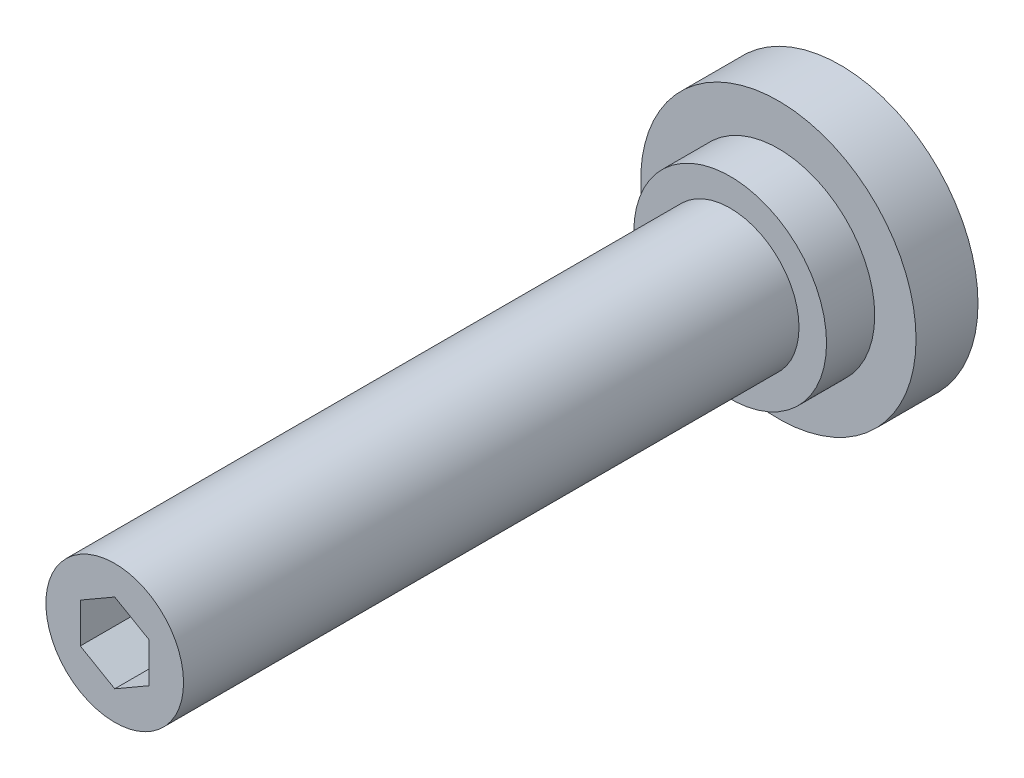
ISO-10303-21;
HEADER;
FILE_DESCRIPTION(('STEP AP214'),'2;1');
FILE_NAME('part.step','',(''),(''),'','','');
FILE_SCHEMA(('AUTOMOTIVE_DESIGN { 1 0 10303 214 1 1 1 1 }'));
ENDSEC;
DATA;
#1=APPLICATION_CONTEXT('core data for automotive mechanical design processes');
#2=APPLICATION_PROTOCOL_DEFINITION('international standard','automotive_design',2000,#1);
#3=PRODUCT_CONTEXT('',#1,'mechanical');
#4=PRODUCT('Part','Part','',(#3));
#5=PRODUCT_RELATED_PRODUCT_CATEGORY('part','',(#4));
#6=PRODUCT_DEFINITION_FORMATION('','',#4);
#7=PRODUCT_DEFINITION_CONTEXT('part definition',#1,'design');
#8=PRODUCT_DEFINITION('design','',#6,#7);
#9=PRODUCT_DEFINITION_SHAPE('','',#8);
#10=(LENGTH_UNIT() NAMED_UNIT(*) SI_UNIT(.MILLI.,.METRE.));
#11=(NAMED_UNIT(*) PLANE_ANGLE_UNIT() SI_UNIT($,.RADIAN.));
#12=(NAMED_UNIT(*) SI_UNIT($,.STERADIAN.) SOLID_ANGLE_UNIT());
#13=UNCERTAINTY_MEASURE_WITH_UNIT(LENGTH_MEASURE(1.E-05),#10,'distance_accuracy_value','');
#14=(GEOMETRIC_REPRESENTATION_CONTEXT(3) GLOBAL_UNCERTAINTY_ASSIGNED_CONTEXT((#13)) GLOBAL_UNIT_ASSIGNED_CONTEXT((#10,
#11,#12)) REPRESENTATION_CONTEXT('',''));
#15=CARTESIAN_POINT('',(0.,0.,0.));
#16=DIRECTION('',(0.,0.,1.));
#17=DIRECTION('',(1.,0.,0.));
#18=AXIS2_PLACEMENT_3D('',#15,#16,#17);
#19=CARTESIAN_POINT('',(0.,0.,105.4));
#20=DIRECTION('',(0.,0.,1.));
#21=DIRECTION('',(1.,0.,0.));
#22=AXIS2_PLACEMENT_3D('',#19,#20,#21);
#23=PLANE('',#22);
#24=DIRECTION('',(-0.866025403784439,0.5,0.));
#25=VECTOR('',#24,1.);
#26=CARTESIAN_POINT('',(5.,2.88675134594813,105.4));
#27=LINE('',#26,#25);
#28=CARTESIAN_POINT('',(5.,2.88675134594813,105.4));
#29=VERTEX_POINT('',#28);
#30=CARTESIAN_POINT('',(0.,5.77350269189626,105.4));
#31=VERTEX_POINT('',#30);
#32=EDGE_CURVE('E28',#29,#31,#27,.T.);
#33=ORIENTED_EDGE('',*,*,#32,.F.);
#34=DIRECTION('',(0.,1.,0.));
#35=VECTOR('',#34,1.);
#36=CARTESIAN_POINT('',(5.,-2.88675134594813,105.4));
#37=LINE('',#36,#35);
#38=CARTESIAN_POINT('',(5.,-2.88675134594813,105.4));
#39=VERTEX_POINT('',#38);
#40=EDGE_CURVE('E111',#39,#29,#37,.T.);
#41=ORIENTED_EDGE('',*,*,#40,.F.);
#42=DIRECTION('',(0.866025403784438,0.5,0.));
#43=VECTOR('',#42,1.);
#44=CARTESIAN_POINT('',(0.,-5.77350269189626,105.4));
#45=LINE('',#44,#43);
#46=CARTESIAN_POINT('',(0.,-5.77350269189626,105.4));
#47=VERTEX_POINT('',#46);
#48=EDGE_CURVE('E109',#47,#39,#45,.T.);
#49=ORIENTED_EDGE('',*,*,#48,.F.);
#50=DIRECTION('',(0.866025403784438,-0.5,0.));
#51=VECTOR('',#50,1.);
#52=CARTESIAN_POINT('',(-5.,-2.88675134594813,105.4));
#53=LINE('',#52,#51);
#54=CARTESIAN_POINT('',(-5.,-2.88675134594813,105.4));
#55=VERTEX_POINT('',#54);
#56=EDGE_CURVE('E76',#55,#47,#53,.T.);
#57=ORIENTED_EDGE('',*,*,#56,.F.);
#58=DIRECTION('',(0.,-1.,0.));
#59=VECTOR('',#58,1.);
#60=CARTESIAN_POINT('',(-5.,2.88675134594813,105.4));
#61=LINE('',#60,#59);
#62=CARTESIAN_POINT('',(-5.,2.88675134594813,105.4));
#63=VERTEX_POINT('',#62);
#64=EDGE_CURVE('E105',#63,#55,#61,.T.);
#65=ORIENTED_EDGE('',*,*,#64,.F.);
#66=DIRECTION('',(-0.866025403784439,-0.5,0.));
#67=VECTOR('',#66,1.);
#68=CARTESIAN_POINT('',(0.,5.77350269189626,105.4));
#69=LINE('',#68,#67);
#70=EDGE_CURVE('E102',#31,#63,#69,.T.);
#71=ORIENTED_EDGE('',*,*,#70,.F.);
#72=EDGE_LOOP('',(#33,#41,#49,#57,#65,#71));
#73=FACE_BOUND('',#72,.T.);
#74=CARTESIAN_POINT('',(0.,0.,105.4));
#75=DIRECTION('',(0.,0.,1.));
#76=DIRECTION('',(1.,0.,0.));
#77=AXIS2_PLACEMENT_3D('',#74,#75,#76);
#78=CIRCLE('',#77,10.);
#79=CARTESIAN_POINT('',(10.,0.,105.4));
#80=VERTEX_POINT('',#79);
#81=EDGE_CURVE('E9',#80,#80,#78,.T.);
#82=ORIENTED_EDGE('',*,*,#81,.T.);
#83=EDGE_LOOP('',(#82));
#84=FACE_BOUND('',#83,.T.);
#85=ADVANCED_FACE('F14',(#73,#84),#23,.T.);
#86=CARTESIAN_POINT('',(0.,0.,30.));
#87=DIRECTION('',(0.,0.,1.));
#88=DIRECTION('',(1.,0.,0.));
#89=AXIS2_PLACEMENT_3D('',#86,#87,#88);
#90=CYLINDRICAL_SURFACE('',#89,10.);
#91=CARTESIAN_POINT('',(0.,0.,16.));
#92=DIRECTION('',(0.,0.,1.));
#93=DIRECTION('',(1.,0.,0.));
#94=AXIS2_PLACEMENT_3D('',#91,#92,#93);
#95=CIRCLE('',#94,10.);
#96=CARTESIAN_POINT('',(10.,0.,16.));
#97=VERTEX_POINT('',#96);
#98=EDGE_CURVE('E21',#97,#97,#95,.T.);
#99=ORIENTED_EDGE('',*,*,#98,.T.);
#100=EDGE_LOOP('',(#99));
#101=FACE_BOUND('',#100,.T.);
#102=ORIENTED_EDGE('',*,*,#81,.F.);
#103=EDGE_LOOP('',(#102));
#104=FACE_BOUND('',#103,.T.);
#105=ADVANCED_FACE('F134',(#101,#104),#90,.T.);
#106=CARTESIAN_POINT('',(-10.,0.,16.));
#107=DIRECTION('',(0.,0.,1.));
#108=DIRECTION('',(1.,0.,0.));
#109=AXIS2_PLACEMENT_3D('',#106,#107,#108);
#110=PLANE('',#109);
#111=CARTESIAN_POINT('',(0.,0.,16.));
#112=DIRECTION('',(0.,0.,1.));
#113=DIRECTION('',(1.,0.,0.));
#114=AXIS2_PLACEMENT_3D('',#111,#112,#113);
#115=CIRCLE('',#114,14.);
#116=CARTESIAN_POINT('',(14.,0.,16.));
#117=VERTEX_POINT('',#116);
#118=EDGE_CURVE('E129',#117,#117,#115,.T.);
#119=ORIENTED_EDGE('',*,*,#118,.T.);
#120=EDGE_LOOP('',(#119));
#121=FACE_BOUND('',#120,.T.);
#122=ORIENTED_EDGE('',*,*,#98,.F.);
#123=EDGE_LOOP('',(#122));
#124=FACE_BOUND('',#123,.T.);
#125=ADVANCED_FACE('F137',(#121,#124),#110,.T.);
#126=CARTESIAN_POINT('',(0.,0.,30.));
#127=DIRECTION('',(0.,0.,1.));
#128=DIRECTION('',(1.,0.,0.));
#129=AXIS2_PLACEMENT_3D('',#126,#127,#128);
#130=CYLINDRICAL_SURFACE('',#129,14.);
#131=CARTESIAN_POINT('',(0.,0.,9.));
#132=DIRECTION('',(0.,0.,1.));
#133=DIRECTION('',(1.,0.,0.));
#134=AXIS2_PLACEMENT_3D('',#131,#132,#133);
#135=CIRCLE('',#134,14.);
#136=CARTESIAN_POINT('',(14.,0.,9.));
#137=VERTEX_POINT('',#136);
#138=EDGE_CURVE('E126',#137,#137,#135,.T.);
#139=ORIENTED_EDGE('',*,*,#138,.T.);
#140=EDGE_LOOP('',(#139));
#141=FACE_BOUND('',#140,.T.);
#142=ORIENTED_EDGE('',*,*,#118,.F.);
#143=EDGE_LOOP('',(#142));
#144=FACE_BOUND('',#143,.T.);
#145=ADVANCED_FACE('F139',(#141,#144),#130,.T.);
#146=CARTESIAN_POINT('',(-14.,0.,9.));
#147=DIRECTION('',(0.,0.,1.));
#148=DIRECTION('',(1.,0.,0.));
#149=AXIS2_PLACEMENT_3D('',#146,#147,#148);
#150=PLANE('',#149);
#151=CARTESIAN_POINT('',(0.,0.,9.));
#152=DIRECTION('',(0.,0.,1.));
#153=DIRECTION('',(1.,0.,0.));
#154=AXIS2_PLACEMENT_3D('',#151,#152,#153);
#155=CIRCLE('',#154,20.);
#156=CARTESIAN_POINT('',(20.,0.,9.));
#157=VERTEX_POINT('',#156);
#158=EDGE_CURVE('E123',#157,#157,#155,.T.);
#159=ORIENTED_EDGE('',*,*,#158,.T.);
#160=EDGE_LOOP('',(#159));
#161=FACE_BOUND('',#160,.T.);
#162=ORIENTED_EDGE('',*,*,#138,.F.);
#163=EDGE_LOOP('',(#162));
#164=FACE_BOUND('',#163,.T.);
#165=ADVANCED_FACE('F147',(#161,#164),#150,.T.);
#166=CARTESIAN_POINT('',(0.,0.,30.));
#167=DIRECTION('',(0.,0.,1.));
#168=DIRECTION('',(1.,0.,0.));
#169=AXIS2_PLACEMENT_3D('',#166,#167,#168);
#170=CYLINDRICAL_SURFACE('',#169,20.);
#171=CARTESIAN_POINT('',(0.,0.,0.));
#172=DIRECTION('',(0.,0.,1.));
#173=DIRECTION('',(1.,0.,0.));
#174=AXIS2_PLACEMENT_3D('',#171,#172,#173);
#175=CIRCLE('',#174,20.);
#176=CARTESIAN_POINT('',(20.,0.,0.));
#177=VERTEX_POINT('',#176);
#178=EDGE_CURVE('E115',#177,#177,#175,.T.);
#179=ORIENTED_EDGE('',*,*,#178,.T.);
#180=EDGE_LOOP('',(#179));
#181=FACE_BOUND('',#180,.T.);
#182=ORIENTED_EDGE('',*,*,#158,.F.);
#183=EDGE_LOOP('',(#182));
#184=FACE_BOUND('',#183,.T.);
#185=ADVANCED_FACE('F172',(#181,#184),#170,.T.);
#186=CARTESIAN_POINT('',(-20.,0.,0.));
#187=DIRECTION('',(0.,0.,-1.));
#188=DIRECTION('',(-1.,0.,0.));
#189=AXIS2_PLACEMENT_3D('',#186,#187,#188);
#190=PLANE('',#189);
#191=ORIENTED_EDGE('',*,*,#178,.F.);
#192=EDGE_LOOP('',(#191));
#193=FACE_BOUND('',#192,.T.);
#194=ADVANCED_FACE('F165',(#193),#190,.T.);
#195=CARTESIAN_POINT('',(5.,2.88675134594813,97.4));
#196=DIRECTION('',(0.5,0.866025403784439,0.));
#197=DIRECTION('',(-0.866025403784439,0.5,0.));
#198=AXIS2_PLACEMENT_3D('',#195,#196,#197);
#199=PLANE('',#198);
#200=ORIENTED_EDGE('',*,*,#32,.T.);
#201=DIRECTION('',(0.,0.,1.));
#202=VECTOR('',#201,1.);
#203=CARTESIAN_POINT('',(0.,5.77350269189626,97.4));
#204=LINE('',#203,#202);
#205=CARTESIAN_POINT('',(0.,5.77350269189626,97.4));
#206=VERTEX_POINT('',#205);
#207=EDGE_CURVE('E58',#206,#31,#204,.T.);
#208=ORIENTED_EDGE('',*,*,#207,.F.);
#209=DIRECTION('',(-0.866025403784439,0.5,0.));
#210=VECTOR('',#209,1.);
#211=CARTESIAN_POINT('',(5.,2.88675134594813,97.4));
#212=LINE('',#211,#210);
#213=CARTESIAN_POINT('',(5.,2.88675134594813,97.4));
#214=VERTEX_POINT('',#213);
#215=EDGE_CURVE('E113',#214,#206,#212,.T.);
#216=ORIENTED_EDGE('',*,*,#215,.F.);
#217=DIRECTION('',(0.,0.,1.));
#218=VECTOR('',#217,1.);
#219=CARTESIAN_POINT('',(5.,2.88675134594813,97.4));
#220=LINE('',#219,#218);
#221=EDGE_CURVE('E36',#214,#29,#220,.T.);
#222=ORIENTED_EDGE('',*,*,#221,.T.);
#223=EDGE_LOOP('',(#200,#208,#216,#222));
#224=FACE_BOUND('',#223,.T.);
#225=ADVANCED_FACE('F162',(#224),#199,.F.);
#226=CARTESIAN_POINT('',(5.,-2.88675134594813,97.4));
#227=DIRECTION('',(1.,0.,0.));
#228=DIRECTION('',(0.,0.,-1.));
#229=AXIS2_PLACEMENT_3D('',#226,#227,#228);
#230=PLANE('',#229);
#231=ORIENTED_EDGE('',*,*,#40,.T.);
#232=ORIENTED_EDGE('',*,*,#221,.F.);
#233=DIRECTION('',(0.,1.,0.));
#234=VECTOR('',#233,1.);
#235=CARTESIAN_POINT('',(5.,-2.88675134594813,97.4));
#236=LINE('',#235,#234);
#237=CARTESIAN_POINT('',(5.,-2.88675134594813,97.4));
#238=VERTEX_POINT('',#237);
#239=EDGE_CURVE('E88',#238,#214,#236,.T.);
#240=ORIENTED_EDGE('',*,*,#239,.F.);
#241=DIRECTION('',(0.,0.,1.));
#242=VECTOR('',#241,1.);
#243=CARTESIAN_POINT('',(5.,-2.88675134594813,97.4));
#244=LINE('',#243,#242);
#245=EDGE_CURVE('E80',#238,#39,#244,.T.);
#246=ORIENTED_EDGE('',*,*,#245,.T.);
#247=EDGE_LOOP('',(#231,#232,#240,#246));
#248=FACE_BOUND('',#247,.T.);
#249=ADVANCED_FACE('F164',(#248),#230,.F.);
#250=CARTESIAN_POINT('',(0.,-5.77350269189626,97.4));
#251=DIRECTION('',(0.5,-0.866025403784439,0.));
#252=DIRECTION('',(0.866025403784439,0.5,0.));
#253=AXIS2_PLACEMENT_3D('',#250,#251,#252);
#254=PLANE('',#253);
#255=ORIENTED_EDGE('',*,*,#48,.T.);
#256=ORIENTED_EDGE('',*,*,#245,.F.);
#257=DIRECTION('',(0.866025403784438,0.5,0.));
#258=VECTOR('',#257,1.);
#259=CARTESIAN_POINT('',(0.,-5.77350269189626,97.4));
#260=LINE('',#259,#258);
#261=CARTESIAN_POINT('',(0.,-5.77350269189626,97.4));
#262=VERTEX_POINT('',#261);
#263=EDGE_CURVE('E84',#262,#238,#260,.T.);
#264=ORIENTED_EDGE('',*,*,#263,.F.);
#265=DIRECTION('',(0.,0.,1.));
#266=VECTOR('',#265,1.);
#267=CARTESIAN_POINT('',(0.,-5.77350269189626,97.4));
#268=LINE('',#267,#266);
#269=EDGE_CURVE('E69',#262,#47,#268,.T.);
#270=ORIENTED_EDGE('',*,*,#269,.T.);
#271=EDGE_LOOP('',(#255,#256,#264,#270));
#272=FACE_BOUND('',#271,.T.);
#273=ADVANCED_FACE('F85',(#272),#254,.F.);
#274=CARTESIAN_POINT('',(-5.,-2.88675134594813,97.4));
#275=DIRECTION('',(-0.5,-0.866025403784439,0.));
#276=DIRECTION('',(0.866025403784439,-0.5,0.));
#277=AXIS2_PLACEMENT_3D('',#274,#275,#276);
#278=PLANE('',#277);
#279=ORIENTED_EDGE('',*,*,#56,.T.);
#280=ORIENTED_EDGE('',*,*,#269,.F.);
#281=DIRECTION('',(0.866025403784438,-0.5,0.));
#282=VECTOR('',#281,1.);
#283=CARTESIAN_POINT('',(-5.,-2.88675134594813,97.4));
#284=LINE('',#283,#282);
#285=CARTESIAN_POINT('',(-5.,-2.88675134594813,97.4));
#286=VERTEX_POINT('',#285);
#287=EDGE_CURVE('E73',#286,#262,#284,.T.);
#288=ORIENTED_EDGE('',*,*,#287,.F.);
#289=DIRECTION('',(0.,0.,1.));
#290=VECTOR('',#289,1.);
#291=CARTESIAN_POINT('',(-5.,-2.88675134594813,97.4));
#292=LINE('',#291,#290);
#293=EDGE_CURVE('E81',#286,#55,#292,.T.);
#294=ORIENTED_EDGE('',*,*,#293,.T.);
#295=EDGE_LOOP('',(#279,#280,#288,#294));
#296=FACE_BOUND('',#295,.T.);
#297=ADVANCED_FACE('F71',(#296),#278,.F.);
#298=CARTESIAN_POINT('',(-5.,2.88675134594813,97.4));
#299=DIRECTION('',(-1.,0.,0.));
#300=DIRECTION('',(0.,-1.,0.));
#301=AXIS2_PLACEMENT_3D('',#298,#299,#300);
#302=PLANE('',#301);
#303=ORIENTED_EDGE('',*,*,#64,.T.);
#304=ORIENTED_EDGE('',*,*,#293,.F.);
#305=DIRECTION('',(0.,-1.,0.));
#306=VECTOR('',#305,1.);
#307=CARTESIAN_POINT('',(-5.,2.88675134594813,97.4));
#308=LINE('',#307,#306);
#309=CARTESIAN_POINT('',(-5.,2.88675134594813,97.4));
#310=VERTEX_POINT('',#309);
#311=EDGE_CURVE('E94',#310,#286,#308,.T.);
#312=ORIENTED_EDGE('',*,*,#311,.F.);
#313=DIRECTION('',(0.,0.,1.));
#314=VECTOR('',#313,1.);
#315=CARTESIAN_POINT('',(-5.,2.88675134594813,97.4));
#316=LINE('',#315,#314);
#317=EDGE_CURVE('E118',#310,#63,#316,.T.);
#318=ORIENTED_EDGE('',*,*,#317,.T.);
#319=EDGE_LOOP('',(#303,#304,#312,#318));
#320=FACE_BOUND('',#319,.T.);
#321=ADVANCED_FACE('F237',(#320),#302,.F.);
#322=CARTESIAN_POINT('',(0.,5.77350269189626,97.4));
#323=DIRECTION('',(-0.5,0.866025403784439,0.));
#324=DIRECTION('',(-0.866025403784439,-0.5,0.));
#325=AXIS2_PLACEMENT_3D('',#322,#323,#324);
#326=PLANE('',#325);
#327=ORIENTED_EDGE('',*,*,#70,.T.);
#328=ORIENTED_EDGE('',*,*,#317,.F.);
#329=DIRECTION('',(-0.866025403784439,-0.5,0.));
#330=VECTOR('',#329,1.);
#331=CARTESIAN_POINT('',(0.,5.77350269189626,97.4));
#332=LINE('',#331,#330);
#333=EDGE_CURVE('E96',#206,#310,#332,.T.);
#334=ORIENTED_EDGE('',*,*,#333,.F.);
#335=ORIENTED_EDGE('',*,*,#207,.T.);
#336=EDGE_LOOP('',(#327,#328,#334,#335));
#337=FACE_BOUND('',#336,.T.);
#338=ADVANCED_FACE('F160',(#337),#326,.F.);
#339=CARTESIAN_POINT('',(0.,5.77350269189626,97.4));
#340=DIRECTION('',(0.,0.,1.));
#341=DIRECTION('',(1.,0.,0.));
#342=AXIS2_PLACEMENT_3D('',#339,#340,#341);
#343=PLANE('',#342);
#344=ORIENTED_EDGE('',*,*,#215,.T.);
#345=ORIENTED_EDGE('',*,*,#333,.T.);
#346=ORIENTED_EDGE('',*,*,#311,.T.);
#347=ORIENTED_EDGE('',*,*,#287,.T.);
#348=ORIENTED_EDGE('',*,*,#263,.T.);
#349=ORIENTED_EDGE('',*,*,#239,.T.);
#350=EDGE_LOOP('',(#344,#345,#346,#347,#348,#349));
#351=FACE_BOUND('',#350,.T.);
#352=ADVANCED_FACE('F91',(#351),#343,.T.);
#353=CLOSED_SHELL('',(#85,#105,#125,#145,#165,#185,#194,#225,#249,#273,#297,#321,#338,#352));
#354=MANIFOLD_SOLID_BREP('B1',#353);
#355=ADVANCED_BREP_SHAPE_REPRESENTATION('',(#18,#354),#14);
#356=SHAPE_DEFINITION_REPRESENTATION(#9,#355);
ENDSEC;
END-ISO-10303-21;
